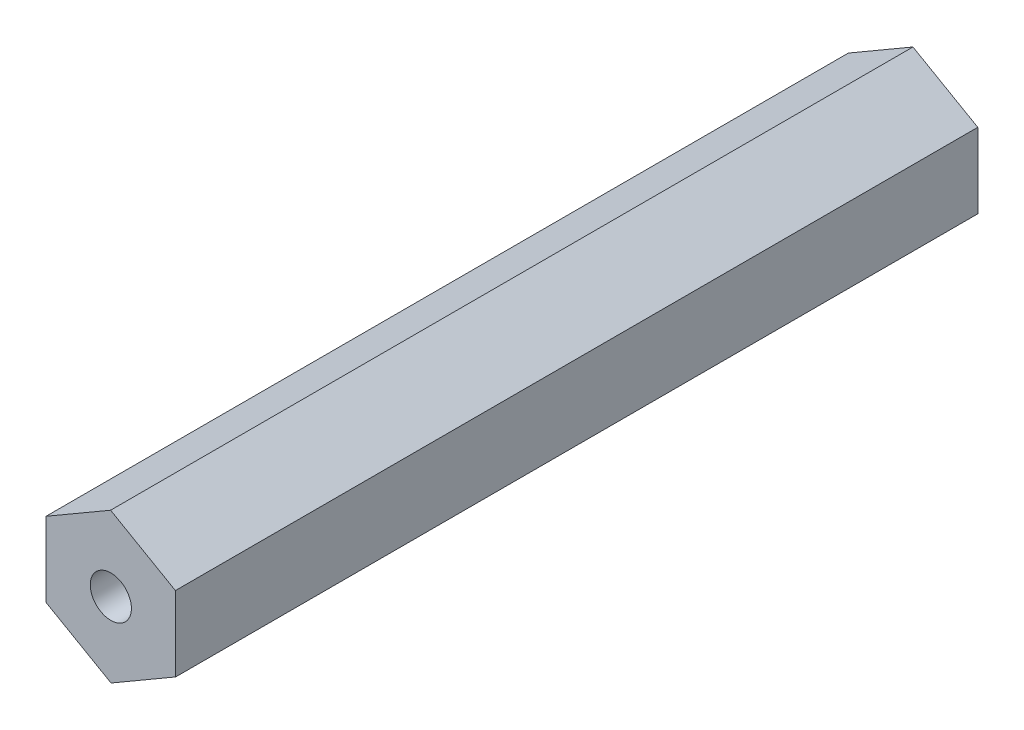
ISO-10303-21;
HEADER;
FILE_DESCRIPTION(('STEP AP214'),'2;1');
FILE_NAME('part.step','',(''),(''),'','','');
FILE_SCHEMA(('AUTOMOTIVE_DESIGN { 1 0 10303 214 1 1 1 1 }'));
ENDSEC;
DATA;
#1=APPLICATION_CONTEXT('core data for automotive mechanical design processes');
#2=APPLICATION_PROTOCOL_DEFINITION('international standard','automotive_design',2000,#1);
#3=PRODUCT_CONTEXT('',#1,'mechanical');
#4=PRODUCT('Part','Part','',(#3));
#5=PRODUCT_RELATED_PRODUCT_CATEGORY('part','',(#4));
#6=PRODUCT_DEFINITION_FORMATION('','',#4);
#7=PRODUCT_DEFINITION_CONTEXT('part definition',#1,'design');
#8=PRODUCT_DEFINITION('design','',#6,#7);
#9=PRODUCT_DEFINITION_SHAPE('','',#8);
#10=(LENGTH_UNIT() NAMED_UNIT(*) SI_UNIT(.MILLI.,.METRE.));
#11=(NAMED_UNIT(*) PLANE_ANGLE_UNIT() SI_UNIT($,.RADIAN.));
#12=(NAMED_UNIT(*) SI_UNIT($,.STERADIAN.) SOLID_ANGLE_UNIT());
#13=UNCERTAINTY_MEASURE_WITH_UNIT(LENGTH_MEASURE(1.E-05),#10,'distance_accuracy_value','');
#14=(GEOMETRIC_REPRESENTATION_CONTEXT(3) GLOBAL_UNCERTAINTY_ASSIGNED_CONTEXT((#13)) GLOBAL_UNIT_ASSIGNED_CONTEXT((#10,
#11,#12)) REPRESENTATION_CONTEXT('',''));
#15=CARTESIAN_POINT('',(0.,0.,0.));
#16=DIRECTION('',(0.,0.,1.));
#17=DIRECTION('',(1.,0.,0.));
#18=AXIS2_PLACEMENT_3D('',#15,#16,#17);
#19=CARTESIAN_POINT('',(0.,0.,78.74));
#20=DIRECTION('',(0.,0.,1.));
#21=DIRECTION('',(1.,0.,0.));
#22=AXIS2_PLACEMENT_3D('',#19,#20,#21);
#23=PLANE('',#22);
#24=DIRECTION('',(0.864504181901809,0.502625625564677,0.));
#25=VECTOR('',#24,1.);
#26=CARTESIAN_POINT('',(0.0222497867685,-7.33231466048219,78.74));
#27=LINE('',#26,#25);
#28=CARTESIAN_POINT('',(0.0222497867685,-7.33231466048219,78.74));
#29=VERTEX_POINT('',#28);
#30=CARTESIAN_POINT('',(6.3610956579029,-3.64688844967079,78.74));
#31=VERTEX_POINT('',#30);
#32=EDGE_CURVE('E129',#29,#31,#27,.T.);
#33=ORIENTED_EDGE('',*,*,#32,.T.);
#34=DIRECTION('',(-0.00303446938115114,0.999995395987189,0.));
#35=VECTOR('',#34,1.);
#36=CARTESIAN_POINT('',(6.3610956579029,-3.64688844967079,78.74));
#37=LINE('',#36,#35);
#38=CARTESIAN_POINT('',(6.3388458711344,3.68542621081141,78.74));
#39=VERTEX_POINT('',#38);
#40=EDGE_CURVE('E87',#31,#39,#37,.T.);
#41=ORIENTED_EDGE('',*,*,#40,.T.);
#42=DIRECTION('',(-0.86753865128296,0.497369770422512,0.));
#43=VECTOR('',#42,1.);
#44=CARTESIAN_POINT('',(6.3388458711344,3.68542621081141,78.74));
#45=LINE('',#44,#43);
#46=CARTESIAN_POINT('',(-0.0222497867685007,7.33231466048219,78.74));
#47=VERTEX_POINT('',#46);
#48=EDGE_CURVE('E100',#39,#47,#45,.T.);
#49=ORIENTED_EDGE('',*,*,#48,.T.);
#50=DIRECTION('',(-0.864504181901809,-0.502625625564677,0.));
#51=VECTOR('',#50,1.);
#52=CARTESIAN_POINT('',(-0.0222497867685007,7.33231466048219,78.74));
#53=LINE('',#52,#51);
#54=CARTESIAN_POINT('',(-6.3610956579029,3.64688844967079,78.74));
#55=VERTEX_POINT('',#54);
#56=EDGE_CURVE('E94',#47,#55,#53,.T.);
#57=ORIENTED_EDGE('',*,*,#56,.T.);
#58=DIRECTION('',(0.0030344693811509,-0.999995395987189,0.));
#59=VECTOR('',#58,1.);
#60=CARTESIAN_POINT('',(-6.3610956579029,3.64688844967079,78.74));
#61=LINE('',#60,#59);
#62=CARTESIAN_POINT('',(-6.3388458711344,-3.6854262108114,78.74));
#63=VERTEX_POINT('',#62);
#64=EDGE_CURVE('E98',#55,#63,#61,.T.);
#65=ORIENTED_EDGE('',*,*,#64,.T.);
#66=DIRECTION('',(0.86753865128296,-0.497369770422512,0.));
#67=VECTOR('',#66,1.);
#68=CARTESIAN_POINT('',(-6.3388458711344,-3.6854262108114,78.74));
#69=LINE('',#68,#67);
#70=EDGE_CURVE('E50',#63,#29,#69,.T.);
#71=ORIENTED_EDGE('',*,*,#70,.T.);
#72=EDGE_LOOP('',(#33,#41,#49,#57,#65,#71));
#73=FACE_BOUND('',#72,.T.);
#74=CARTESIAN_POINT('',(0.,0.,78.74));
#75=DIRECTION('',(0.,0.,1.));
#76=DIRECTION('',(1.,0.,0.));
#77=AXIS2_PLACEMENT_3D('',#74,#75,#76);
#78=CIRCLE('',#77,2.0193);
#79=CARTESIAN_POINT('',(2.0193,0.,78.74));
#80=VERTEX_POINT('',#79);
#81=EDGE_CURVE('E122',#80,#80,#78,.T.);
#82=ORIENTED_EDGE('',*,*,#81,.F.);
#83=EDGE_LOOP('',(#82));
#84=FACE_BOUND('',#83,.T.);
#85=ADVANCED_FACE('F33',(#73,#84),#23,.T.);
#86=CARTESIAN_POINT('',(0.,0.,0.));
#87=DIRECTION('',(0.,0.,1.));
#88=DIRECTION('',(1.,0.,0.));
#89=AXIS2_PLACEMENT_3D('',#86,#87,#88);
#90=PLANE('',#89);
#91=DIRECTION('',(0.864504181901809,0.502625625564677,0.));
#92=VECTOR('',#91,1.);
#93=CARTESIAN_POINT('',(0.0222497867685,-7.33231466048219,0.));
#94=LINE('',#93,#92);
#95=CARTESIAN_POINT('',(0.0222497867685,-7.33231466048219,0.));
#96=VERTEX_POINT('',#95);
#97=CARTESIAN_POINT('',(6.3610956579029,-3.64688844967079,0.));
#98=VERTEX_POINT('',#97);
#99=EDGE_CURVE('E118',#96,#98,#94,.T.);
#100=ORIENTED_EDGE('',*,*,#99,.F.);
#101=DIRECTION('',(0.86753865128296,-0.497369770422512,0.));
#102=VECTOR('',#101,1.);
#103=CARTESIAN_POINT('',(-6.3388458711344,-3.6854262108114,0.));
#104=LINE('',#103,#102);
#105=CARTESIAN_POINT('',(-6.3388458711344,-3.6854262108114,0.));
#106=VERTEX_POINT('',#105);
#107=EDGE_CURVE('E79',#106,#96,#104,.T.);
#108=ORIENTED_EDGE('',*,*,#107,.F.);
#109=DIRECTION('',(0.0030344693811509,-0.999995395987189,0.));
#110=VECTOR('',#109,1.);
#111=CARTESIAN_POINT('',(-6.3610956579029,3.64688844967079,0.));
#112=LINE('',#111,#110);
#113=CARTESIAN_POINT('',(-6.3610956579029,3.64688844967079,0.));
#114=VERTEX_POINT('',#113);
#115=EDGE_CURVE('E73',#114,#106,#112,.T.);
#116=ORIENTED_EDGE('',*,*,#115,.F.);
#117=DIRECTION('',(-0.864504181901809,-0.502625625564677,0.));
#118=VECTOR('',#117,1.);
#119=CARTESIAN_POINT('',(-0.0222497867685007,7.33231466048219,0.));
#120=LINE('',#119,#118);
#121=CARTESIAN_POINT('',(-0.0222497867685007,7.33231466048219,0.));
#122=VERTEX_POINT('',#121);
#123=EDGE_CURVE('E108',#122,#114,#120,.T.);
#124=ORIENTED_EDGE('',*,*,#123,.F.);
#125=DIRECTION('',(-0.86753865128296,0.497369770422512,0.));
#126=VECTOR('',#125,1.);
#127=CARTESIAN_POINT('',(6.3388458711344,3.68542621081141,0.));
#128=LINE('',#127,#126);
#129=CARTESIAN_POINT('',(6.3388458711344,3.68542621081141,0.));
#130=VERTEX_POINT('',#129);
#131=EDGE_CURVE('E124',#130,#122,#128,.T.);
#132=ORIENTED_EDGE('',*,*,#131,.F.);
#133=DIRECTION('',(-0.00303446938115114,0.999995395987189,0.));
#134=VECTOR('',#133,1.);
#135=CARTESIAN_POINT('',(6.3610956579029,-3.64688844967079,0.));
#136=LINE('',#135,#134);
#137=EDGE_CURVE('E121',#98,#130,#136,.T.);
#138=ORIENTED_EDGE('',*,*,#137,.F.);
#139=EDGE_LOOP('',(#100,#108,#116,#124,#132,#138));
#140=FACE_BOUND('',#139,.T.);
#141=CARTESIAN_POINT('',(0.,0.,0.));
#142=DIRECTION('',(0.,0.,1.));
#143=DIRECTION('',(1.,0.,0.));
#144=AXIS2_PLACEMENT_3D('',#141,#142,#143);
#145=CIRCLE('',#144,2.0193);
#146=CARTESIAN_POINT('',(2.0193,0.,0.));
#147=VERTEX_POINT('',#146);
#148=EDGE_CURVE('E222',#147,#147,#145,.T.);
#149=ORIENTED_EDGE('',*,*,#148,.T.);
#150=EDGE_LOOP('',(#149));
#151=FACE_BOUND('',#150,.T.);
#152=ADVANCED_FACE('F138',(#140,#151),#90,.F.);
#153=CARTESIAN_POINT('',(0.0222497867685,-7.33231466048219,78.74));
#154=DIRECTION('',(-0.502625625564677,0.864504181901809,0.));
#155=DIRECTION('',(-0.864504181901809,-0.502625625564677,0.));
#156=AXIS2_PLACEMENT_3D('',#153,#154,#155);
#157=PLANE('',#156);
#158=ORIENTED_EDGE('',*,*,#99,.T.);
#159=DIRECTION('',(0.,0.,-1.));
#160=VECTOR('',#159,1.);
#161=CARTESIAN_POINT('',(6.3610956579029,-3.64688844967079,78.74));
#162=LINE('',#161,#160);
#163=EDGE_CURVE('E11',#31,#98,#162,.T.);
#164=ORIENTED_EDGE('',*,*,#163,.F.);
#165=ORIENTED_EDGE('',*,*,#32,.F.);
#166=DIRECTION('',(0.,0.,-1.));
#167=VECTOR('',#166,1.);
#168=CARTESIAN_POINT('',(0.0222497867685,-7.33231466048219,78.74));
#169=LINE('',#168,#167);
#170=EDGE_CURVE('E114',#29,#96,#169,.T.);
#171=ORIENTED_EDGE('',*,*,#170,.T.);
#172=EDGE_LOOP('',(#158,#164,#165,#171));
#173=FACE_BOUND('',#172,.T.);
#174=ADVANCED_FACE('F35',(#173),#157,.F.);
#175=CARTESIAN_POINT('',(6.3610956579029,-3.64688844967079,78.74));
#176=DIRECTION('',(-0.999995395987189,-0.00303446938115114,0.));
#177=DIRECTION('',(0.00303446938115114,-0.999995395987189,0.));
#178=AXIS2_PLACEMENT_3D('',#175,#176,#177);
#179=PLANE('',#178);
#180=ORIENTED_EDGE('',*,*,#137,.T.);
#181=DIRECTION('',(0.,0.,-1.));
#182=VECTOR('',#181,1.);
#183=CARTESIAN_POINT('',(6.3388458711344,3.68542621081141,78.74));
#184=LINE('',#183,#182);
#185=EDGE_CURVE('E42',#39,#130,#184,.T.);
#186=ORIENTED_EDGE('',*,*,#185,.F.);
#187=ORIENTED_EDGE('',*,*,#40,.F.);
#188=ORIENTED_EDGE('',*,*,#163,.T.);
#189=EDGE_LOOP('',(#180,#186,#187,#188));
#190=FACE_BOUND('',#189,.T.);
#191=ADVANCED_FACE('F163',(#190),#179,.F.);
#192=CARTESIAN_POINT('',(6.3388458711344,3.68542621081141,78.74));
#193=DIRECTION('',(-0.497369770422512,-0.86753865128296,0.));
#194=DIRECTION('',(0.867538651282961,-0.497369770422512,0.));
#195=AXIS2_PLACEMENT_3D('',#192,#193,#194);
#196=PLANE('',#195);
#197=ORIENTED_EDGE('',*,*,#131,.T.);
#198=DIRECTION('',(0.,0.,-1.));
#199=VECTOR('',#198,1.);
#200=CARTESIAN_POINT('',(-0.0222497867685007,7.33231466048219,78.74));
#201=LINE('',#200,#199);
#202=EDGE_CURVE('E109',#47,#122,#201,.T.);
#203=ORIENTED_EDGE('',*,*,#202,.F.);
#204=ORIENTED_EDGE('',*,*,#48,.F.);
#205=ORIENTED_EDGE('',*,*,#185,.T.);
#206=EDGE_LOOP('',(#197,#203,#204,#205));
#207=FACE_BOUND('',#206,.T.);
#208=ADVANCED_FACE('F135',(#207),#196,.F.);
#209=CARTESIAN_POINT('',(-0.0222497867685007,7.33231466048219,78.74));
#210=DIRECTION('',(0.502625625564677,-0.864504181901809,0.));
#211=DIRECTION('',(0.864504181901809,0.502625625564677,0.));
#212=AXIS2_PLACEMENT_3D('',#209,#210,#211);
#213=PLANE('',#212);
#214=ORIENTED_EDGE('',*,*,#123,.T.);
#215=DIRECTION('',(0.,0.,-1.));
#216=VECTOR('',#215,1.);
#217=CARTESIAN_POINT('',(-6.3610956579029,3.64688844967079,78.74));
#218=LINE('',#217,#216);
#219=EDGE_CURVE('E105',#55,#114,#218,.T.);
#220=ORIENTED_EDGE('',*,*,#219,.F.);
#221=ORIENTED_EDGE('',*,*,#56,.F.);
#222=ORIENTED_EDGE('',*,*,#202,.T.);
#223=EDGE_LOOP('',(#214,#220,#221,#222));
#224=FACE_BOUND('',#223,.T.);
#225=ADVANCED_FACE('F106',(#224),#213,.F.);
#226=CARTESIAN_POINT('',(-6.3610956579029,3.64688844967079,78.74));
#227=DIRECTION('',(0.999995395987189,0.0030344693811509,0.));
#228=DIRECTION('',(-0.0030344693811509,0.999995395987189,0.));
#229=AXIS2_PLACEMENT_3D('',#226,#227,#228);
#230=PLANE('',#229);
#231=ORIENTED_EDGE('',*,*,#115,.T.);
#232=DIRECTION('',(0.,0.,-1.));
#233=VECTOR('',#232,1.);
#234=CARTESIAN_POINT('',(-6.3388458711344,-3.6854262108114,78.74));
#235=LINE('',#234,#233);
#236=EDGE_CURVE('E110',#63,#106,#235,.T.);
#237=ORIENTED_EDGE('',*,*,#236,.F.);
#238=ORIENTED_EDGE('',*,*,#64,.F.);
#239=ORIENTED_EDGE('',*,*,#219,.T.);
#240=EDGE_LOOP('',(#231,#237,#238,#239));
#241=FACE_BOUND('',#240,.T.);
#242=ADVANCED_FACE('F112',(#241),#230,.F.);
#243=CARTESIAN_POINT('',(-6.3388458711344,-3.6854262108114,78.74));
#244=DIRECTION('',(0.497369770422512,0.86753865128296,0.));
#245=DIRECTION('',(-0.86753865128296,0.497369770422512,0.));
#246=AXIS2_PLACEMENT_3D('',#243,#244,#245);
#247=PLANE('',#246);
#248=ORIENTED_EDGE('',*,*,#107,.T.);
#249=ORIENTED_EDGE('',*,*,#170,.F.);
#250=ORIENTED_EDGE('',*,*,#70,.F.);
#251=ORIENTED_EDGE('',*,*,#236,.T.);
#252=EDGE_LOOP('',(#248,#249,#250,#251));
#253=FACE_BOUND('',#252,.T.);
#254=ADVANCED_FACE('F143',(#253),#247,.F.);
#255=CARTESIAN_POINT('',(0.,0.,78.74));
#256=DIRECTION('',(0.,0.,-1.));
#257=DIRECTION('',(-1.,0.,0.));
#258=AXIS2_PLACEMENT_3D('',#255,#256,#257);
#259=CYLINDRICAL_SURFACE('',#258,2.0193);
#260=ORIENTED_EDGE('',*,*,#81,.T.);
#261=EDGE_LOOP('',(#260));
#262=FACE_BOUND('',#261,.T.);
#263=ORIENTED_EDGE('',*,*,#148,.F.);
#264=EDGE_LOOP('',(#263));
#265=FACE_BOUND('',#264,.T.);
#266=ADVANCED_FACE('F145',(#262,#265),#259,.F.);
#267=CLOSED_SHELL('',(#85,#152,#174,#191,#208,#225,#242,#254,#266));
#268=MANIFOLD_SOLID_BREP('B2',#267);
#269=ADVANCED_BREP_SHAPE_REPRESENTATION('',(#18,#268),#14);
#270=SHAPE_DEFINITION_REPRESENTATION(#9,#269);
ENDSEC;
END-ISO-10303-21;
